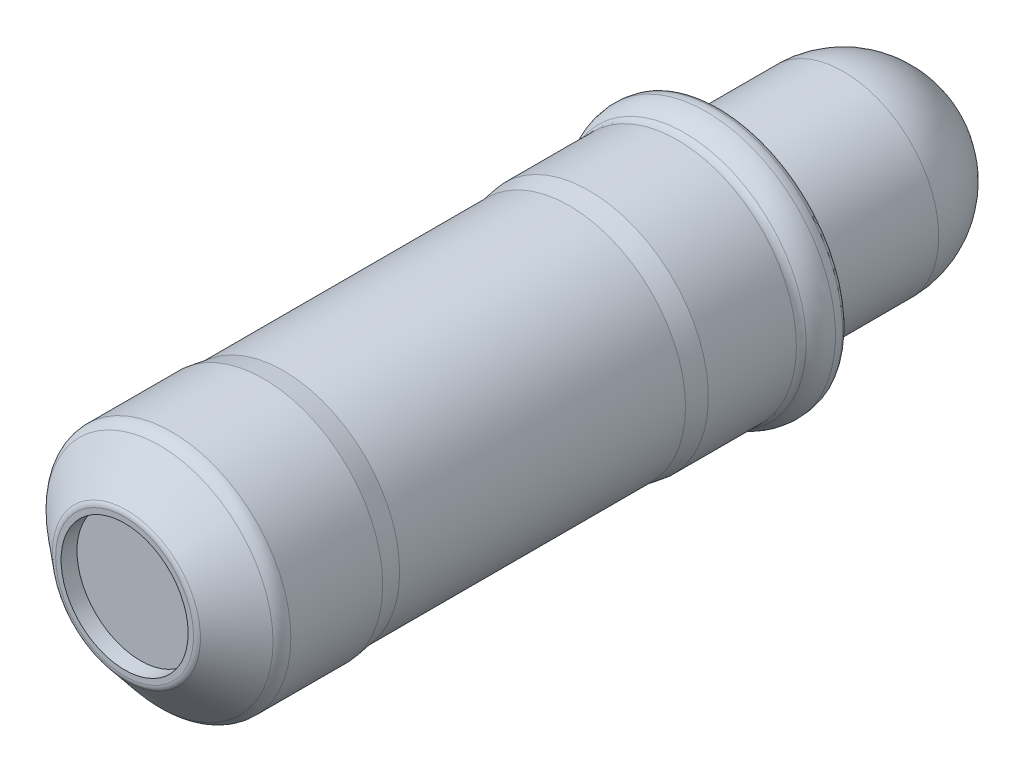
ISO-10303-21;
HEADER;
FILE_DESCRIPTION(('STEP AP214'),'2;1');
FILE_NAME('part.step','',(''),(''),'','','');
FILE_SCHEMA(('AUTOMOTIVE_DESIGN { 1 0 10303 214 1 1 1 1 }'));
ENDSEC;
DATA;
#1=APPLICATION_CONTEXT('core data for automotive mechanical design processes');
#2=APPLICATION_PROTOCOL_DEFINITION('international standard','automotive_design',2000,#1);
#3=PRODUCT_CONTEXT('',#1,'mechanical');
#4=PRODUCT('Part','Part','',(#3));
#5=PRODUCT_RELATED_PRODUCT_CATEGORY('part','',(#4));
#6=PRODUCT_DEFINITION_FORMATION('','',#4);
#7=PRODUCT_DEFINITION_CONTEXT('part definition',#1,'design');
#8=PRODUCT_DEFINITION('design','',#6,#7);
#9=PRODUCT_DEFINITION_SHAPE('','',#8);
#10=(LENGTH_UNIT() NAMED_UNIT(*) SI_UNIT(.MILLI.,.METRE.));
#11=(NAMED_UNIT(*) PLANE_ANGLE_UNIT() SI_UNIT($,.RADIAN.));
#12=(NAMED_UNIT(*) SI_UNIT($,.STERADIAN.) SOLID_ANGLE_UNIT());
#13=UNCERTAINTY_MEASURE_WITH_UNIT(LENGTH_MEASURE(1.E-05),#10,'distance_accuracy_value','');
#14=(GEOMETRIC_REPRESENTATION_CONTEXT(3) GLOBAL_UNCERTAINTY_ASSIGNED_CONTEXT((#13)) GLOBAL_UNIT_ASSIGNED_CONTEXT((#10,
#11,#12)) REPRESENTATION_CONTEXT('',''));
#15=CARTESIAN_POINT('',(0.,0.,0.));
#16=DIRECTION('',(0.,0.,1.));
#17=DIRECTION('',(1.,0.,0.));
#18=AXIS2_PLACEMENT_3D('',#15,#16,#17);
#19=CARTESIAN_POINT('',(0.,0.,5.5));
#20=DIRECTION('',(0.,0.,1.));
#21=DIRECTION('',(1.,0.,0.));
#22=AXIS2_PLACEMENT_3D('',#19,#20,#21);
#23=CYLINDRICAL_SURFACE('',#22,1.6);
#24=CARTESIAN_POINT('',(0.,0.,20.5));
#25=DIRECTION('',(0.,0.,1.));
#26=DIRECTION('',(1.,0.,0.));
#27=AXIS2_PLACEMENT_3D('',#24,#25,#26);
#28=CIRCLE('',#27,1.6);
#29=CARTESIAN_POINT('',(1.6,0.,20.5));
#30=VERTEX_POINT('',#29);
#31=EDGE_CURVE('E154',#30,#30,#28,.F.);
#32=ORIENTED_EDGE('',*,*,#31,.F.);
#33=EDGE_LOOP('',(#32));
#34=FACE_BOUND('',#33,.T.);
#35=CARTESIAN_POINT('',(0.,0.,20.1));
#36=DIRECTION('',(0.,0.,1.));
#37=DIRECTION('',(1.,0.,0.));
#38=AXIS2_PLACEMENT_3D('',#35,#36,#37);
#39=CIRCLE('',#38,1.6);
#40=CARTESIAN_POINT('',(1.6,0.,20.1));
#41=VERTEX_POINT('',#40);
#42=EDGE_CURVE('E161',#41,#41,#39,.T.);
#43=ORIENTED_EDGE('',*,*,#42,.F.);
#44=EDGE_LOOP('',(#43));
#45=FACE_BOUND('',#44,.T.);
#46=ADVANCED_FACE('F12',(#34,#45),#23,.F.);
#47=CARTESIAN_POINT('',(0.,2.39,5.5));
#48=DIRECTION('',(0.,0.,-1.));
#49=DIRECTION('',(-1.,0.,0.));
#50=AXIS2_PLACEMENT_3D('',#47,#48,#49);
#51=PLANE('',#50);
#52=CARTESIAN_POINT('',(0.,0.,5.5));
#53=DIRECTION('',(0.,0.,-1.));
#54=DIRECTION('',(-1.,0.,0.));
#55=AXIS2_PLACEMENT_3D('',#52,#53,#54);
#56=CIRCLE('',#55,2.4);
#57=CARTESIAN_POINT('',(-2.4,0.,5.5));
#58=VERTEX_POINT('',#57);
#59=EDGE_CURVE('E15',#58,#58,#56,.F.);
#60=ORIENTED_EDGE('',*,*,#59,.T.);
#61=EDGE_LOOP('',(#60));
#62=FACE_BOUND('',#61,.T.);
#63=CARTESIAN_POINT('',(0.,0.,5.50000000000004));
#64=DIRECTION('',(0.,0.,1.));
#65=DIRECTION('',(-1.,0.,0.));
#66=AXIS2_PLACEMENT_3D('',#63,#64,#65);
#67=CIRCLE('',#66,3.032);
#68=CARTESIAN_POINT('',(-3.032,0.,5.50000000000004));
#69=VERTEX_POINT('',#68);
#70=EDGE_CURVE('E150',#69,#69,#67,.T.);
#71=ORIENTED_EDGE('',*,*,#70,.F.);
#72=EDGE_LOOP('',(#71));
#73=FACE_BOUND('',#72,.T.);
#74=ADVANCED_FACE('F132',(#62,#73),#51,.T.);
#75=CARTESIAN_POINT('',(0.,1.73545236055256,20.5));
#76=DIRECTION('',(0.,0.,1.));
#77=DIRECTION('',(1.,0.,0.));
#78=AXIS2_PLACEMENT_3D('',#75,#76,#77);
#79=PLANE('',#78);
#80=CARTESIAN_POINT('',(0.,0.,20.5));
#81=DIRECTION('',(0.,0.,-1.));
#82=DIRECTION('',(-1.,0.,0.));
#83=AXIS2_PLACEMENT_3D('',#80,#81,#82);
#84=CIRCLE('',#83,1.73545236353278);
#85=CARTESIAN_POINT('',(-1.73545236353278,0.,20.5));
#86=VERTEX_POINT('',#85);
#87=EDGE_CURVE('E120',#86,#86,#84,.T.);
#88=ORIENTED_EDGE('',*,*,#87,.F.);
#89=EDGE_LOOP('',(#88));
#90=FACE_BOUND('',#89,.T.);
#91=ORIENTED_EDGE('',*,*,#31,.T.);
#92=EDGE_LOOP('',(#91));
#93=FACE_BOUND('',#92,.T.);
#94=ADVANCED_FACE('F124',(#90,#93),#79,.T.);
#95=CARTESIAN_POINT('',(0.,0.,5.6999931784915));
#96=DIRECTION('',(0.,0.,-1.));
#97=DIRECTION('',(-1.,0.,0.));
#98=AXIS2_PLACEMENT_3D('',#95,#96,#97);
#99=TOROIDAL_SURFACE('',#98,3.03034816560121,0.199999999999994);
#100=ORIENTED_EDGE('',*,*,#70,.T.);
#101=EDGE_LOOP('',(#100));
#102=FACE_BOUND('',#101,.T.);
#103=CARTESIAN_POINT('',(0.,0.,5.649000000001));
#104=DIRECTION('',(0.,0.,-1.));
#105=DIRECTION('',(-1.,0.,0.));
#106=AXIS2_PLACEMENT_3D('',#103,#104,#105);
#107=CIRCLE('',#106,3.22373817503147);
#108=CARTESIAN_POINT('',(-3.22373817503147,0.,5.649000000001));
#109=VERTEX_POINT('',#108);
#110=EDGE_CURVE('E89',#109,#109,#107,.F.);
#111=ORIENTED_EDGE('',*,*,#110,.F.);
#112=EDGE_LOOP('',(#111));
#113=FACE_BOUND('',#112,.T.);
#114=ADVANCED_FACE('F106',(#102,#113),#99,.T.);
#115=CARTESIAN_POINT('',(0.,0.,20.3));
#116=DIRECTION('',(0.,0.,-1.));
#117=DIRECTION('',(-1.,0.,0.));
#118=AXIS2_PLACEMENT_3D('',#115,#116,#117);
#119=TOROIDAL_SURFACE('',#118,1.73545236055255,0.2);
#120=CARTESIAN_POINT('',(0.,0.,20.4532088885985));
#121=DIRECTION('',(0.,0.,-1.));
#122=DIRECTION('',(-1.,0.,0.));
#123=AXIS2_PLACEMENT_3D('',#120,#121,#122);
#124=CIRCLE('',#123,1.8640098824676);
#125=CARTESIAN_POINT('',(-1.8640098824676,0.,20.4532088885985));
#126=VERTEX_POINT('',#125);
#127=EDGE_CURVE('E84',#126,#126,#124,.T.);
#128=ORIENTED_EDGE('',*,*,#127,.F.);
#129=EDGE_LOOP('',(#128));
#130=FACE_BOUND('',#129,.T.);
#131=ORIENTED_EDGE('',*,*,#87,.T.);
#132=EDGE_LOOP('',(#131));
#133=FACE_BOUND('',#132,.T.);
#134=ADVANCED_FACE('F100',(#130,#133),#119,.T.);
#135=CARTESIAN_POINT('',(0.,0.,5.851));
#136=DIRECTION('',(0.,0.,-1.));
#137=DIRECTION('',(-1.,0.,0.));
#138=AXIS2_PLACEMENT_3D('',#135,#136,#137);
#139=TOROIDAL_SURFACE('',#138,2.45999999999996,0.790000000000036);
#140=ORIENTED_EDGE('',*,*,#110,.T.);
#141=EDGE_LOOP('',(#140));
#142=FACE_BOUND('',#141,.T.);
#143=CARTESIAN_POINT('',(0.,0.,5.851));
#144=DIRECTION('',(0.,0.,-1.));
#145=DIRECTION('',(-1.,0.,0.));
#146=AXIS2_PLACEMENT_3D('',#143,#144,#145);
#147=CIRCLE('',#146,3.25);
#148=CARTESIAN_POINT('',(-3.25,0.,5.851));
#149=VERTEX_POINT('',#148);
#150=EDGE_CURVE('E78',#149,#149,#147,.F.);
#151=ORIENTED_EDGE('',*,*,#150,.F.);
#152=EDGE_LOOP('',(#151));
#153=FACE_BOUND('',#152,.T.);
#154=ADVANCED_FACE('F96',(#142,#153),#139,.T.);
#155=CARTESIAN_POINT('',(0.,0.,19.6198947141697));
#156=DIRECTION('',(0.,0.,-1.));
#157=DIRECTION('',(0.,1.,0.));
#158=AXIS2_PLACEMENT_3D('',#155,#156,#157);
#159=CONICAL_SURFACE('',#158,2.85711504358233,0.872664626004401);
#160=CARTESIAN_POINT('',(0.,0.,19.6198947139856));
#161=DIRECTION('',(0.,0.,-1.));
#162=DIRECTION('',(-1.,0.,0.));
#163=AXIS2_PLACEMENT_3D('',#160,#161,#162);
#164=CIRCLE('',#163,2.85711504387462);
#165=CARTESIAN_POINT('',(-2.85711504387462,0.,19.6198947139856));
#166=VERTEX_POINT('',#165);
#167=EDGE_CURVE('E75',#166,#166,#164,.T.);
#168=ORIENTED_EDGE('',*,*,#167,.F.);
#169=EDGE_LOOP('',(#168));
#170=FACE_BOUND('',#169,.T.);
#171=ORIENTED_EDGE('',*,*,#127,.T.);
#172=EDGE_LOOP('',(#171));
#173=FACE_BOUND('',#172,.T.);
#174=ADVANCED_FACE('F99',(#170,#173),#159,.T.);
#175=CARTESIAN_POINT('',(0.,0.,5.851));
#176=DIRECTION('',(0.,0.,-1.));
#177=DIRECTION('',(-1.,0.,0.));
#178=AXIS2_PLACEMENT_3D('',#175,#176,#177);
#179=TOROIDAL_SURFACE('',#178,2.35,0.9);
#180=ORIENTED_EDGE('',*,*,#150,.T.);
#181=EDGE_LOOP('',(#180));
#182=FACE_BOUND('',#181,.T.);
#183=CARTESIAN_POINT('',(0.,0.,6.40085794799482));
#184=DIRECTION('',(0.,0.,-1.));
#185=DIRECTION('',(-1.,0.,0.));
#186=AXIS2_PLACEMENT_3D('',#183,#184,#185);
#187=CIRCLE('',#186,3.06249999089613);
#188=CARTESIAN_POINT('',(-3.06249999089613,0.,6.40085794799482));
#189=VERTEX_POINT('',#188);
#190=EDGE_CURVE('E50',#189,#189,#187,.T.);
#191=ORIENTED_EDGE('',*,*,#190,.T.);
#192=EDGE_LOOP('',(#191));
#193=FACE_BOUND('',#192,.T.);
#194=ADVANCED_FACE('F68',(#182,#193),#179,.T.);
#195=CARTESIAN_POINT('',(0.,0.,19.313476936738));
#196=DIRECTION('',(0.,0.,-1.));
#197=DIRECTION('',(-1.,0.,0.));
#198=AXIS2_PLACEMENT_3D('',#195,#196,#197);
#199=TOROIDAL_SURFACE('',#198,2.6,0.4);
#200=CARTESIAN_POINT('',(0.,0.,19.313476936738));
#201=DIRECTION('',(0.,0.,1.));
#202=DIRECTION('',(1.,0.,0.));
#203=AXIS2_PLACEMENT_3D('',#200,#201,#202);
#204=CIRCLE('',#203,3.);
#205=CARTESIAN_POINT('',(3.,0.,19.313476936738));
#206=VERTEX_POINT('',#205);
#207=EDGE_CURVE('E45',#206,#206,#204,.F.);
#208=ORIENTED_EDGE('',*,*,#207,.F.);
#209=EDGE_LOOP('',(#208));
#210=FACE_BOUND('',#209,.T.);
#211=ORIENTED_EDGE('',*,*,#167,.T.);
#212=EDGE_LOOP('',(#211));
#213=FACE_BOUND('',#212,.T.);
#214=ADVANCED_FACE('F62',(#210,#213),#199,.T.);
#215=CARTESIAN_POINT('',(0.,0.,6.5841439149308));
#216=DIRECTION('',(0.,0.,-1.));
#217=DIRECTION('',(-1.,0.,0.));
#218=AXIS2_PLACEMENT_3D('',#215,#216,#217);
#219=TOROIDAL_SURFACE('',#218,3.3,0.299999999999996);
#220=CARTESIAN_POINT('',(0.,0.,6.5841439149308));
#221=DIRECTION('',(0.,0.,1.));
#222=DIRECTION('',(1.,0.,0.));
#223=AXIS2_PLACEMENT_3D('',#220,#221,#222);
#224=CIRCLE('',#223,3.);
#225=CARTESIAN_POINT('',(3.,0.,6.5841439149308));
#226=VERTEX_POINT('',#225);
#227=EDGE_CURVE('E40',#226,#226,#224,.T.);
#228=ORIENTED_EDGE('',*,*,#227,.F.);
#229=EDGE_LOOP('',(#228));
#230=FACE_BOUND('',#229,.T.);
#231=ORIENTED_EDGE('',*,*,#190,.F.);
#232=EDGE_LOOP('',(#231));
#233=FACE_BOUND('',#232,.T.);
#234=ADVANCED_FACE('F57',(#230,#233),#219,.F.);
#235=CARTESIAN_POINT('',(0.,0.,5.5));
#236=DIRECTION('',(0.,0.,1.));
#237=DIRECTION('',(1.,0.,0.));
#238=AXIS2_PLACEMENT_3D('',#235,#236,#237);
#239=CYLINDRICAL_SURFACE('',#238,3.);
#240=CARTESIAN_POINT('',(0.,0.,17.0000000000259));
#241=DIRECTION('',(0.,0.,1.));
#242=DIRECTION('',(1.,0.,0.));
#243=AXIS2_PLACEMENT_3D('',#240,#241,#242);
#244=CIRCLE('',#243,3.00000000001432);
#245=CARTESIAN_POINT('',(3.00000000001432,0.,17.0000000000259));
#246=VERTEX_POINT('',#245);
#247=EDGE_CURVE('E35',#246,#246,#244,.F.);
#248=ORIENTED_EDGE('',*,*,#247,.F.);
#249=EDGE_LOOP('',(#248));
#250=FACE_BOUND('',#249,.T.);
#251=ORIENTED_EDGE('',*,*,#207,.T.);
#252=EDGE_LOOP('',(#251));
#253=FACE_BOUND('',#252,.T.);
#254=ADVANCED_FACE('F61',(#250,#253),#239,.T.);
#255=CARTESIAN_POINT('',(0.,0.,5.5));
#256=DIRECTION('',(0.,0.,1.));
#257=DIRECTION('',(1.,0.,0.));
#258=AXIS2_PLACEMENT_3D('',#255,#256,#257);
#259=CYLINDRICAL_SURFACE('',#258,3.);
#260=ORIENTED_EDGE('',*,*,#227,.T.);
#261=EDGE_LOOP('',(#260));
#262=FACE_BOUND('',#261,.T.);
#263=CARTESIAN_POINT('',(0.,0.,8.79999999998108));
#264=DIRECTION('',(0.,0.,-1.));
#265=DIRECTION('',(-1.,0.,0.));
#266=AXIS2_PLACEMENT_3D('',#263,#264,#265);
#267=CIRCLE('',#266,3.00000000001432);
#268=CARTESIAN_POINT('',(-3.00000000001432,0.,8.79999999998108));
#269=VERTEX_POINT('',#268);
#270=EDGE_CURVE('E24',#269,#269,#267,.F.);
#271=ORIENTED_EDGE('',*,*,#270,.F.);
#272=EDGE_LOOP('',(#271));
#273=FACE_BOUND('',#272,.T.);
#274=ADVANCED_FACE('F242',(#262,#273),#259,.T.);
#275=CARTESIAN_POINT('',(0.,0.,16.9999999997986));
#276=DIRECTION('',(0.,0.,1.));
#277=DIRECTION('',(1.,0.,0.));
#278=AXIS2_PLACEMENT_3D('',#275,#276,#277);
#279=CONICAL_SURFACE('',#278,2.99999999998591,0.148352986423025);
#280=CARTESIAN_POINT('',(0.,0.,16.4981632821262));
#281=DIRECTION('',(0.,0.,1.));
#282=DIRECTION('',(1.,0.,0.));
#283=AXIS2_PLACEMENT_3D('',#280,#281,#282);
#284=CIRCLE('',#283,2.925);
#285=CARTESIAN_POINT('',(2.925,0.,16.4981632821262));
#286=VERTEX_POINT('',#285);
#287=EDGE_CURVE('E19',#286,#286,#284,.F.);
#288=ORIENTED_EDGE('',*,*,#287,.F.);
#289=EDGE_LOOP('',(#288));
#290=FACE_BOUND('',#289,.T.);
#291=ORIENTED_EDGE('',*,*,#247,.T.);
#292=EDGE_LOOP('',(#291));
#293=FACE_BOUND('',#292,.T.);
#294=ADVANCED_FACE('F249',(#290,#293),#279,.T.);
#295=CARTESIAN_POINT('',(0.,0.,8.80000000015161));
#296=DIRECTION('',(0.,0.,-1.));
#297=DIRECTION('',(-1.,0.,0.));
#298=AXIS2_PLACEMENT_3D('',#295,#296,#297);
#299=CONICAL_SURFACE('',#298,2.99999999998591,0.148352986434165);
#300=ORIENTED_EDGE('',*,*,#270,.T.);
#301=EDGE_LOOP('',(#300));
#302=FACE_BOUND('',#301,.T.);
#303=CARTESIAN_POINT('',(0.,0.,9.3018367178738));
#304=DIRECTION('',(0.,0.,1.));
#305=DIRECTION('',(1.,0.,0.));
#306=AXIS2_PLACEMENT_3D('',#303,#304,#305);
#307=CIRCLE('',#306,2.925);
#308=CARTESIAN_POINT('',(2.925,0.,9.3018367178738));
#309=VERTEX_POINT('',#308);
#310=EDGE_CURVE('E8',#309,#309,#307,.T.);
#311=ORIENTED_EDGE('',*,*,#310,.F.);
#312=EDGE_LOOP('',(#311));
#313=FACE_BOUND('',#312,.T.);
#314=ADVANCED_FACE('F184',(#302,#313),#299,.T.);
#315=CARTESIAN_POINT('',(0.,0.,5.5));
#316=DIRECTION('',(0.,0.,1.));
#317=DIRECTION('',(1.,0.,0.));
#318=AXIS2_PLACEMENT_3D('',#315,#316,#317);
#319=CYLINDRICAL_SURFACE('',#318,2.925);
#320=ORIENTED_EDGE('',*,*,#310,.T.);
#321=EDGE_LOOP('',(#320));
#322=FACE_BOUND('',#321,.T.);
#323=ORIENTED_EDGE('',*,*,#287,.T.);
#324=EDGE_LOOP('',(#323));
#325=FACE_BOUND('',#324,.T.);
#326=ADVANCED_FACE('F174',(#322,#325),#319,.T.);
#327=CARTESIAN_POINT('',(0.,0.,2.4));
#328=DIRECTION('',(0.,0.,1.));
#329=DIRECTION('',(-1.,0.,0.));
#330=AXIS2_PLACEMENT_3D('',#327,#328,#329);
#331=SPHERICAL_SURFACE('',#330,2.4);
#332=CARTESIAN_POINT('',(0.,0.,2.4));
#333=DIRECTION('',(0.,0.,1.));
#334=DIRECTION('',(1.,0.,0.));
#335=AXIS2_PLACEMENT_3D('',#332,#333,#334);
#336=CIRCLE('',#335,2.4);
#337=CARTESIAN_POINT('',(2.4,0.,2.4));
#338=VERTEX_POINT('',#337);
#339=EDGE_CURVE('E28',#338,#338,#336,.T.);
#340=ORIENTED_EDGE('',*,*,#339,.F.);
#341=EDGE_LOOP('',(#340));
#342=FACE_BOUND('',#341,.T.);
#343=ADVANCED_FACE('F172',(#342),#331,.T.);
#344=CARTESIAN_POINT('',(0.,0.,22.146470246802));
#345=DIRECTION('',(0.,0.,1.));
#346=DIRECTION('',(1.,0.,0.));
#347=AXIS2_PLACEMENT_3D('',#344,#345,#346);
#348=CYLINDRICAL_SURFACE('',#347,2.4);
#349=ORIENTED_EDGE('',*,*,#59,.F.);
#350=EDGE_LOOP('',(#349));
#351=FACE_BOUND('',#350,.T.);
#352=ORIENTED_EDGE('',*,*,#339,.T.);
#353=EDGE_LOOP('',(#352));
#354=FACE_BOUND('',#353,.T.);
#355=ADVANCED_FACE('F170',(#351,#354),#348,.T.);
#356=CARTESIAN_POINT('',(0.,0.,20.1));
#357=DIRECTION('',(0.,0.,-1.));
#358=DIRECTION('',(-1.,0.,0.));
#359=AXIS2_PLACEMENT_3D('',#356,#357,#358);
#360=PLANE('',#359);
#361=ORIENTED_EDGE('',*,*,#42,.T.);
#362=EDGE_LOOP('',(#361));
#363=FACE_BOUND('',#362,.T.);
#364=ADVANCED_FACE('F181',(#363),#360,.F.);
#365=CLOSED_SHELL('',(#46,#74,#94,#114,#134,#154,#174,#194,#214,#234,#254,#274,#294,#314,#326,
#343,#355,#364));
#366=MANIFOLD_SOLID_BREP('B1',#365);
#367=ADVANCED_BREP_SHAPE_REPRESENTATION('',(#18,#366),#14);
#368=SHAPE_DEFINITION_REPRESENTATION(#9,#367);
ENDSEC;
END-ISO-10303-21;
